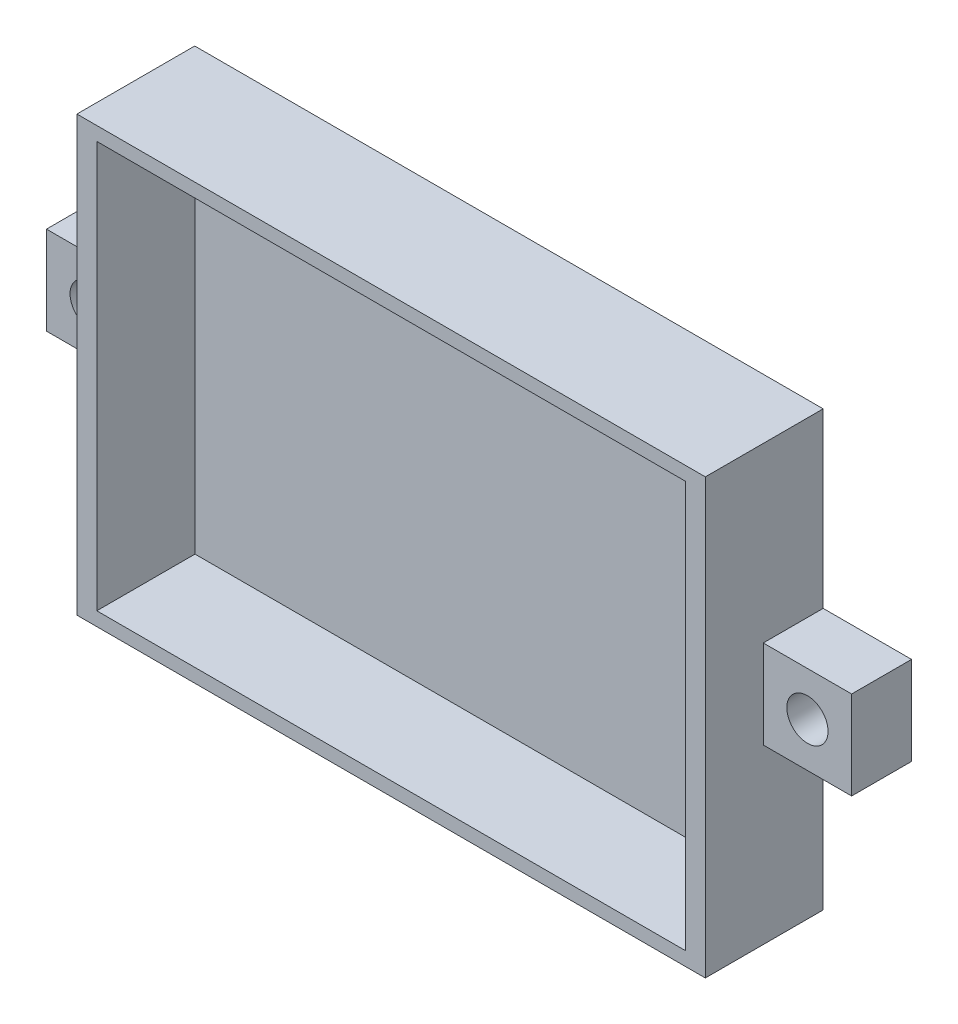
ISO-10303-21;
HEADER;
FILE_DESCRIPTION(('STEP AP214'),'2;1');
FILE_NAME('part.step','',(''),(''),'','','');
FILE_SCHEMA(('AUTOMOTIVE_DESIGN { 1 0 10303 214 1 1 1 1 }'));
ENDSEC;
DATA;
#1=APPLICATION_CONTEXT('core data for automotive mechanical design processes');
#2=APPLICATION_PROTOCOL_DEFINITION('international standard','automotive_design',2000,#1);
#3=PRODUCT_CONTEXT('',#1,'mechanical');
#4=PRODUCT('Part','Part','',(#3));
#5=PRODUCT_RELATED_PRODUCT_CATEGORY('part','',(#4));
#6=PRODUCT_DEFINITION_FORMATION('','',#4);
#7=PRODUCT_DEFINITION_CONTEXT('part definition',#1,'design');
#8=PRODUCT_DEFINITION('design','',#6,#7);
#9=PRODUCT_DEFINITION_SHAPE('','',#8);
#10=(LENGTH_UNIT() NAMED_UNIT(*) SI_UNIT(.MILLI.,.METRE.));
#11=(NAMED_UNIT(*) PLANE_ANGLE_UNIT() SI_UNIT($,.RADIAN.));
#12=(NAMED_UNIT(*) SI_UNIT($,.STERADIAN.) SOLID_ANGLE_UNIT());
#13=UNCERTAINTY_MEASURE_WITH_UNIT(LENGTH_MEASURE(1.E-05),#10,'distance_accuracy_value','');
#14=(GEOMETRIC_REPRESENTATION_CONTEXT(3) GLOBAL_UNCERTAINTY_ASSIGNED_CONTEXT((#13)) GLOBAL_UNIT_ASSIGNED_CONTEXT((#10,
#11,#12)) REPRESENTATION_CONTEXT('',''));
#15=CARTESIAN_POINT('',(0.,0.,0.));
#16=DIRECTION('',(0.,0.,1.));
#17=DIRECTION('',(1.,0.,0.));
#18=AXIS2_PLACEMENT_3D('',#15,#16,#17);
#19=CARTESIAN_POINT('',(0.,22.1,2.));
#20=DIRECTION('',(0.,-1.,0.));
#21=DIRECTION('',(1.,0.,0.));
#22=AXIS2_PLACEMENT_3D('',#19,#20,#21);
#23=PLANE('',#22);
#24=DIRECTION('',(-1.,0.,0.));
#25=VECTOR('',#24,1.);
#26=CARTESIAN_POINT('',(0.,22.1,0.));
#27=LINE('',#26,#25);
#28=CARTESIAN_POINT('',(32.,22.1,0.));
#29=VERTEX_POINT('',#28);
#30=CARTESIAN_POINT('',(-32.,22.1,0.));
#31=VERTEX_POINT('',#30);
#32=EDGE_CURVE('E265',#29,#31,#27,.T.);
#33=ORIENTED_EDGE('',*,*,#32,.T.);
#34=DIRECTION('',(0.,0.,-1.));
#35=VECTOR('',#34,1.);
#36=CARTESIAN_POINT('',(-32.,22.1,2.));
#37=LINE('',#36,#35);
#38=CARTESIAN_POINT('',(-32.,22.1,12.));
#39=VERTEX_POINT('',#38);
#40=EDGE_CURVE('E40',#39,#31,#37,.T.);
#41=ORIENTED_EDGE('',*,*,#40,.F.);
#42=DIRECTION('',(-1.,0.,0.));
#43=VECTOR('',#42,1.);
#44=CARTESIAN_POINT('',(32.,22.1,12.));
#45=LINE('',#44,#43);
#46=CARTESIAN_POINT('',(32.,22.1,12.));
#47=VERTEX_POINT('',#46);
#48=EDGE_CURVE('E194',#47,#39,#45,.T.);
#49=ORIENTED_EDGE('',*,*,#48,.F.);
#50=DIRECTION('',(0.,0.,-1.));
#51=VECTOR('',#50,1.);
#52=CARTESIAN_POINT('',(32.,22.1,2.));
#53=LINE('',#52,#51);
#54=EDGE_CURVE('E279',#47,#29,#53,.T.);
#55=ORIENTED_EDGE('',*,*,#54,.T.);
#56=EDGE_LOOP('',(#33,#41,#49,#55));
#57=FACE_BOUND('',#56,.T.);
#58=ADVANCED_FACE('F37',(#57),#23,.F.);
#59=CARTESIAN_POINT('',(-32.,0.,2.));
#60=DIRECTION('',(1.,0.,0.));
#61=DIRECTION('',(0.,1.,0.));
#62=AXIS2_PLACEMENT_3D('',#59,#60,#61);
#63=PLANE('',#62);
#64=DIRECTION('',(0.,0.,-1.));
#65=VECTOR('',#64,1.);
#66=CARTESIAN_POINT('',(-32.,-22.1,2.));
#67=LINE('',#66,#65);
#68=CARTESIAN_POINT('',(-32.,-22.1,12.));
#69=VERTEX_POINT('',#68);
#70=CARTESIAN_POINT('',(-32.,-22.1,0.));
#71=VERTEX_POINT('',#70);
#72=EDGE_CURVE('E283',#69,#71,#67,.T.);
#73=ORIENTED_EDGE('',*,*,#72,.F.);
#74=DIRECTION('',(0.,-1.,0.));
#75=VECTOR('',#74,1.);
#76=CARTESIAN_POINT('',(-32.,-22.1,12.));
#77=LINE('',#76,#75);
#78=EDGE_CURVE('E164',#39,#69,#77,.T.);
#79=ORIENTED_EDGE('',*,*,#78,.F.);
#80=ORIENTED_EDGE('',*,*,#40,.T.);
#81=DIRECTION('',(0.,-1.,0.));
#82=VECTOR('',#81,1.);
#83=CARTESIAN_POINT('',(-32.,0.,0.));
#84=LINE('',#83,#82);
#85=CARTESIAN_POINT('',(-32.,4.49999999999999,0.));
#86=VERTEX_POINT('',#85);
#87=EDGE_CURVE('E269',#31,#86,#84,.T.);
#88=ORIENTED_EDGE('',*,*,#87,.T.);
#89=DIRECTION('',(0.,0.,-1.));
#90=VECTOR('',#89,1.);
#91=CARTESIAN_POINT('',(-32.,4.49999999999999,6.1));
#92=LINE('',#91,#90);
#93=CARTESIAN_POINT('',(-32.,4.49999999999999,6.1));
#94=VERTEX_POINT('',#93);
#95=EDGE_CURVE('E228',#94,#86,#92,.T.);
#96=ORIENTED_EDGE('',*,*,#95,.F.);
#97=DIRECTION('',(0.,-1.,0.));
#98=VECTOR('',#97,1.);
#99=CARTESIAN_POINT('',(-32.,0.,6.1));
#100=LINE('',#99,#98);
#101=CARTESIAN_POINT('',(-32.,-4.50000000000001,6.1));
#102=VERTEX_POINT('',#101);
#103=EDGE_CURVE('E243',#94,#102,#100,.T.);
#104=ORIENTED_EDGE('',*,*,#103,.T.);
#105=DIRECTION('',(0.,0.,-1.));
#106=VECTOR('',#105,1.);
#107=CARTESIAN_POINT('',(-32.,-4.5,6.1));
#108=LINE('',#107,#106);
#109=CARTESIAN_POINT('',(-32.,-4.5,0.));
#110=VERTEX_POINT('',#109);
#111=EDGE_CURVE('E258',#102,#110,#108,.T.);
#112=ORIENTED_EDGE('',*,*,#111,.T.);
#113=EDGE_CURVE('E268',#110,#71,#84,.T.);
#114=ORIENTED_EDGE('',*,*,#113,.T.);
#115=EDGE_LOOP('',(#73,#79,#80,#88,#96,#104,#112,#114));
#116=FACE_BOUND('',#115,.T.);
#117=ADVANCED_FACE('F291',(#116),#63,.F.);
#118=CARTESIAN_POINT('',(0.,-22.1,2.));
#119=DIRECTION('',(0.,-1.,0.));
#120=DIRECTION('',(1.,0.,0.));
#121=AXIS2_PLACEMENT_3D('',#118,#119,#120);
#122=PLANE('',#121);
#123=DIRECTION('',(-1.,0.,0.));
#124=VECTOR('',#123,1.);
#125=CARTESIAN_POINT('',(0.,-22.1,0.));
#126=LINE('',#125,#124);
#127=CARTESIAN_POINT('',(32.,-22.1,0.));
#128=VERTEX_POINT('',#127);
#129=EDGE_CURVE('E272',#128,#71,#126,.T.);
#130=ORIENTED_EDGE('',*,*,#129,.F.);
#131=DIRECTION('',(0.,0.,-1.));
#132=VECTOR('',#131,1.);
#133=CARTESIAN_POINT('',(32.,-22.1,2.));
#134=LINE('',#133,#132);
#135=CARTESIAN_POINT('',(32.,-22.1,12.));
#136=VERTEX_POINT('',#135);
#137=EDGE_CURVE('E281',#136,#128,#134,.T.);
#138=ORIENTED_EDGE('',*,*,#137,.F.);
#139=DIRECTION('',(1.,0.,0.));
#140=VECTOR('',#139,1.);
#141=CARTESIAN_POINT('',(32.,-22.1,12.));
#142=LINE('',#141,#140);
#143=EDGE_CURVE('E188',#69,#136,#142,.T.);
#144=ORIENTED_EDGE('',*,*,#143,.F.);
#145=ORIENTED_EDGE('',*,*,#72,.T.);
#146=EDGE_LOOP('',(#130,#138,#144,#145));
#147=FACE_BOUND('',#146,.T.);
#148=ADVANCED_FACE('F318',(#147),#122,.T.);
#149=CARTESIAN_POINT('',(32.,0.,2.));
#150=DIRECTION('',(1.,0.,0.));
#151=DIRECTION('',(0.,1.,0.));
#152=AXIS2_PLACEMENT_3D('',#149,#150,#151);
#153=PLANE('',#152);
#154=DIRECTION('',(0.,0.,-1.));
#155=VECTOR('',#154,1.);
#156=CARTESIAN_POINT('',(32.,-4.5,6.1));
#157=LINE('',#156,#155);
#158=CARTESIAN_POINT('',(32.,-4.5,6.1));
#159=VERTEX_POINT('',#158);
#160=CARTESIAN_POINT('',(32.,-4.5,0.));
#161=VERTEX_POINT('',#160);
#162=EDGE_CURVE('E11',#159,#161,#157,.T.);
#163=ORIENTED_EDGE('',*,*,#162,.F.);
#164=DIRECTION('',(0.,-1.,0.));
#165=VECTOR('',#164,1.);
#166=CARTESIAN_POINT('',(32.,0.,6.1));
#167=LINE('',#166,#165);
#168=CARTESIAN_POINT('',(32.,4.5,6.1));
#169=VERTEX_POINT('',#168);
#170=EDGE_CURVE('E208',#169,#159,#167,.T.);
#171=ORIENTED_EDGE('',*,*,#170,.F.);
#172=DIRECTION('',(0.,0.,-1.));
#173=VECTOR('',#172,1.);
#174=CARTESIAN_POINT('',(32.,4.5,6.1));
#175=LINE('',#174,#173);
#176=CARTESIAN_POINT('',(32.,4.5,0.));
#177=VERTEX_POINT('',#176);
#178=EDGE_CURVE('E45',#169,#177,#175,.T.);
#179=ORIENTED_EDGE('',*,*,#178,.T.);
#180=DIRECTION('',(0.,-1.,0.));
#181=VECTOR('',#180,1.);
#182=CARTESIAN_POINT('',(32.,0.,0.));
#183=LINE('',#182,#181);
#184=EDGE_CURVE('E276',#29,#177,#183,.T.);
#185=ORIENTED_EDGE('',*,*,#184,.F.);
#186=ORIENTED_EDGE('',*,*,#54,.F.);
#187=DIRECTION('',(0.,1.,0.));
#188=VECTOR('',#187,1.);
#189=CARTESIAN_POINT('',(32.,-22.1,12.));
#190=LINE('',#189,#188);
#191=EDGE_CURVE('E191',#136,#47,#190,.T.);
#192=ORIENTED_EDGE('',*,*,#191,.F.);
#193=ORIENTED_EDGE('',*,*,#137,.T.);
#194=EDGE_CURVE('E275',#161,#128,#183,.T.);
#195=ORIENTED_EDGE('',*,*,#194,.F.);
#196=EDGE_LOOP('',(#163,#171,#179,#185,#186,#192,#193,#195));
#197=FACE_BOUND('',#196,.T.);
#198=ADVANCED_FACE('F301',(#197),#153,.T.);
#199=CARTESIAN_POINT('',(0.,0.,0.));
#200=DIRECTION('',(0.,0.,1.));
#201=DIRECTION('',(1.,0.,0.));
#202=AXIS2_PLACEMENT_3D('',#199,#200,#201);
#203=PLANE('',#202);
#204=ORIENTED_EDGE('',*,*,#32,.F.);
#205=ORIENTED_EDGE('',*,*,#184,.T.);
#206=DIRECTION('',(1.,0.,0.));
#207=VECTOR('',#206,1.);
#208=CARTESIAN_POINT('',(0.,4.5,0.));
#209=LINE('',#208,#207);
#210=CARTESIAN_POINT('',(41.,4.5,0.));
#211=VERTEX_POINT('',#210);
#212=EDGE_CURVE('E219',#177,#211,#209,.T.);
#213=ORIENTED_EDGE('',*,*,#212,.T.);
#214=DIRECTION('',(0.,-1.,0.));
#215=VECTOR('',#214,1.);
#216=CARTESIAN_POINT('',(41.,0.,0.));
#217=LINE('',#216,#215);
#218=CARTESIAN_POINT('',(41.,-4.5,0.));
#219=VERTEX_POINT('',#218);
#220=EDGE_CURVE('E216',#211,#219,#217,.T.);
#221=ORIENTED_EDGE('',*,*,#220,.T.);
#222=DIRECTION('',(1.,0.,0.));
#223=VECTOR('',#222,1.);
#224=CARTESIAN_POINT('',(0.,-4.5,0.));
#225=LINE('',#224,#223);
#226=EDGE_CURVE('E202',#161,#219,#225,.T.);
#227=ORIENTED_EDGE('',*,*,#226,.F.);
#228=ORIENTED_EDGE('',*,*,#194,.T.);
#229=ORIENTED_EDGE('',*,*,#129,.T.);
#230=ORIENTED_EDGE('',*,*,#113,.F.);
#231=DIRECTION('',(-1.,0.,0.));
#232=VECTOR('',#231,1.);
#233=CARTESIAN_POINT('',(0.,-4.5,0.));
#234=LINE('',#233,#232);
#235=CARTESIAN_POINT('',(-41.,-4.50000000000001,0.));
#236=VERTEX_POINT('',#235);
#237=EDGE_CURVE('E235',#110,#236,#234,.T.);
#238=ORIENTED_EDGE('',*,*,#237,.T.);
#239=DIRECTION('',(0.,-1.,0.));
#240=VECTOR('',#239,1.);
#241=CARTESIAN_POINT('',(-41.,0.,0.));
#242=LINE('',#241,#240);
#243=CARTESIAN_POINT('',(-41.,4.49999999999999,0.));
#244=VERTEX_POINT('',#243);
#245=EDGE_CURVE('E252',#244,#236,#242,.T.);
#246=ORIENTED_EDGE('',*,*,#245,.F.);
#247=DIRECTION('',(-1.,0.,0.));
#248=VECTOR('',#247,1.);
#249=CARTESIAN_POINT('',(0.,4.5,0.));
#250=LINE('',#249,#248);
#251=EDGE_CURVE('E249',#86,#244,#250,.T.);
#252=ORIENTED_EDGE('',*,*,#251,.F.);
#253=ORIENTED_EDGE('',*,*,#87,.F.);
#254=EDGE_LOOP('',(#204,#205,#213,#221,#227,#228,#229,#230,#238,#246,#252,#253));
#255=FACE_BOUND('',#254,.T.);
#256=CARTESIAN_POINT('',(-36.5,0.,0.));
#257=DIRECTION('',(0.,0.,1.));
#258=DIRECTION('',(1.,0.,0.));
#259=AXIS2_PLACEMENT_3D('',#256,#257,#258);
#260=CIRCLE('',#259,2.1);
#261=CARTESIAN_POINT('',(-34.4,0.,0.));
#262=VERTEX_POINT('',#261);
#263=EDGE_CURVE('E230',#262,#262,#260,.T.);
#264=ORIENTED_EDGE('',*,*,#263,.T.);
#265=EDGE_LOOP('',(#264));
#266=FACE_BOUND('',#265,.T.);
#267=CARTESIAN_POINT('',(36.5,0.,0.));
#268=DIRECTION('',(0.,0.,1.));
#269=DIRECTION('',(1.,0.,0.));
#270=AXIS2_PLACEMENT_3D('',#267,#268,#269);
#271=CIRCLE('',#270,2.1);
#272=CARTESIAN_POINT('',(38.6,0.,0.));
#273=VERTEX_POINT('',#272);
#274=EDGE_CURVE('E197',#273,#273,#271,.T.);
#275=ORIENTED_EDGE('',*,*,#274,.T.);
#276=EDGE_LOOP('',(#275));
#277=FACE_BOUND('',#276,.T.);
#278=ADVANCED_FACE('F297',(#255,#266,#277),#203,.F.);
#279=CARTESIAN_POINT('',(0.,4.5,6.1));
#280=DIRECTION('',(0.,-1.,0.));
#281=DIRECTION('',(1.,0.,0.));
#282=AXIS2_PLACEMENT_3D('',#279,#280,#281);
#283=PLANE('',#282);
#284=ORIENTED_EDGE('',*,*,#251,.T.);
#285=DIRECTION('',(0.,0.,-1.));
#286=VECTOR('',#285,1.);
#287=CARTESIAN_POINT('',(-41.,4.49999999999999,6.1));
#288=LINE('',#287,#286);
#289=CARTESIAN_POINT('',(-41.,4.49999999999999,6.1));
#290=VERTEX_POINT('',#289);
#291=EDGE_CURVE('E262',#290,#244,#288,.T.);
#292=ORIENTED_EDGE('',*,*,#291,.F.);
#293=DIRECTION('',(-1.,0.,0.));
#294=VECTOR('',#293,1.);
#295=CARTESIAN_POINT('',(0.,4.5,6.1));
#296=LINE('',#295,#294);
#297=EDGE_CURVE('E234',#94,#290,#296,.T.);
#298=ORIENTED_EDGE('',*,*,#297,.F.);
#299=ORIENTED_EDGE('',*,*,#95,.T.);
#300=EDGE_LOOP('',(#284,#292,#298,#299));
#301=FACE_BOUND('',#300,.T.);
#302=ADVANCED_FACE('F343',(#301),#283,.F.);
#303=CARTESIAN_POINT('',(-41.,0.,6.1));
#304=DIRECTION('',(1.,0.,0.));
#305=DIRECTION('',(0.,0.,-1.));
#306=AXIS2_PLACEMENT_3D('',#303,#304,#305);
#307=PLANE('',#306);
#308=ORIENTED_EDGE('',*,*,#245,.T.);
#309=DIRECTION('',(0.,0.,-1.));
#310=VECTOR('',#309,1.);
#311=CARTESIAN_POINT('',(-41.,-4.50000000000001,6.1));
#312=LINE('',#311,#310);
#313=CARTESIAN_POINT('',(-41.,-4.50000000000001,6.1));
#314=VERTEX_POINT('',#313);
#315=EDGE_CURVE('E246',#314,#236,#312,.T.);
#316=ORIENTED_EDGE('',*,*,#315,.F.);
#317=DIRECTION('',(0.,-1.,0.));
#318=VECTOR('',#317,1.);
#319=CARTESIAN_POINT('',(-41.,0.,6.1));
#320=LINE('',#319,#318);
#321=EDGE_CURVE('E238',#290,#314,#320,.T.);
#322=ORIENTED_EDGE('',*,*,#321,.F.);
#323=ORIENTED_EDGE('',*,*,#291,.T.);
#324=EDGE_LOOP('',(#308,#316,#322,#323));
#325=FACE_BOUND('',#324,.T.);
#326=ADVANCED_FACE('F356',(#325),#307,.F.);
#327=CARTESIAN_POINT('',(0.,-4.5,6.1));
#328=DIRECTION('',(0.,-1.,0.));
#329=DIRECTION('',(1.,0.,0.));
#330=AXIS2_PLACEMENT_3D('',#327,#328,#329);
#331=PLANE('',#330);
#332=ORIENTED_EDGE('',*,*,#237,.F.);
#333=ORIENTED_EDGE('',*,*,#111,.F.);
#334=DIRECTION('',(-1.,0.,0.));
#335=VECTOR('',#334,1.);
#336=CARTESIAN_POINT('',(0.,-4.5,6.1));
#337=LINE('',#336,#335);
#338=EDGE_CURVE('E240',#102,#314,#337,.T.);
#339=ORIENTED_EDGE('',*,*,#338,.T.);
#340=ORIENTED_EDGE('',*,*,#315,.T.);
#341=EDGE_LOOP('',(#332,#333,#339,#340));
#342=FACE_BOUND('',#341,.T.);
#343=ADVANCED_FACE('F352',(#342),#331,.T.);
#344=CARTESIAN_POINT('',(-36.5,0.,6.1));
#345=DIRECTION('',(0.,0.,-1.));
#346=DIRECTION('',(-1.,0.,0.));
#347=AXIS2_PLACEMENT_3D('',#344,#345,#346);
#348=CYLINDRICAL_SURFACE('',#347,2.1);
#349=CARTESIAN_POINT('',(-36.5,0.,6.1));
#350=DIRECTION('',(0.,0.,1.));
#351=DIRECTION('',(1.,0.,0.));
#352=AXIS2_PLACEMENT_3D('',#349,#350,#351);
#353=CIRCLE('',#352,2.1);
#354=CARTESIAN_POINT('',(-34.4,0.,6.1));
#355=VERTEX_POINT('',#354);
#356=EDGE_CURVE('E231',#355,#355,#353,.T.);
#357=ORIENTED_EDGE('',*,*,#356,.T.);
#358=EDGE_LOOP('',(#357));
#359=FACE_BOUND('',#358,.T.);
#360=ORIENTED_EDGE('',*,*,#263,.F.);
#361=EDGE_LOOP('',(#360));
#362=FACE_BOUND('',#361,.T.);
#363=ADVANCED_FACE('F348',(#359,#362),#348,.F.);
#364=CARTESIAN_POINT('',(0.,0.,6.1));
#365=DIRECTION('',(0.,0.,1.));
#366=DIRECTION('',(1.,0.,0.));
#367=AXIS2_PLACEMENT_3D('',#364,#365,#366);
#368=PLANE('',#367);
#369=ORIENTED_EDGE('',*,*,#356,.F.);
#370=EDGE_LOOP('',(#369));
#371=FACE_BOUND('',#370,.T.);
#372=ORIENTED_EDGE('',*,*,#297,.T.);
#373=ORIENTED_EDGE('',*,*,#321,.T.);
#374=ORIENTED_EDGE('',*,*,#338,.F.);
#375=ORIENTED_EDGE('',*,*,#103,.F.);
#376=EDGE_LOOP('',(#372,#373,#374,#375));
#377=FACE_BOUND('',#376,.T.);
#378=ADVANCED_FACE('F351',(#371,#377),#368,.T.);
#379=CARTESIAN_POINT('',(41.,0.,6.1));
#380=DIRECTION('',(1.,0.,0.));
#381=DIRECTION('',(0.,0.,-1.));
#382=AXIS2_PLACEMENT_3D('',#379,#380,#381);
#383=PLANE('',#382);
#384=ORIENTED_EDGE('',*,*,#220,.F.);
#385=DIRECTION('',(0.,0.,-1.));
#386=VECTOR('',#385,1.);
#387=CARTESIAN_POINT('',(41.,4.5,6.1));
#388=LINE('',#387,#386);
#389=CARTESIAN_POINT('',(41.,4.5,6.1));
#390=VERTEX_POINT('',#389);
#391=EDGE_CURVE('E224',#390,#211,#388,.T.);
#392=ORIENTED_EDGE('',*,*,#391,.F.);
#393=DIRECTION('',(0.,-1.,0.));
#394=VECTOR('',#393,1.);
#395=CARTESIAN_POINT('',(41.,0.,6.1));
#396=LINE('',#395,#394);
#397=CARTESIAN_POINT('',(41.,-4.5,6.1));
#398=VERTEX_POINT('',#397);
#399=EDGE_CURVE('E201',#390,#398,#396,.T.);
#400=ORIENTED_EDGE('',*,*,#399,.T.);
#401=DIRECTION('',(0.,0.,-1.));
#402=VECTOR('',#401,1.);
#403=CARTESIAN_POINT('',(41.,-4.5,6.1));
#404=LINE('',#403,#402);
#405=EDGE_CURVE('E213',#398,#219,#404,.T.);
#406=ORIENTED_EDGE('',*,*,#405,.T.);
#407=EDGE_LOOP('',(#384,#392,#400,#406));
#408=FACE_BOUND('',#407,.T.);
#409=ADVANCED_FACE('F311',(#408),#383,.T.);
#410=CARTESIAN_POINT('',(0.,4.5,6.1));
#411=DIRECTION('',(0.,1.,0.));
#412=DIRECTION('',(0.,0.,1.));
#413=AXIS2_PLACEMENT_3D('',#410,#411,#412);
#414=PLANE('',#413);
#415=ORIENTED_EDGE('',*,*,#212,.F.);
#416=ORIENTED_EDGE('',*,*,#178,.F.);
#417=DIRECTION('',(1.,0.,0.));
#418=VECTOR('',#417,1.);
#419=CARTESIAN_POINT('',(0.,4.5,6.1));
#420=LINE('',#419,#418);
#421=EDGE_CURVE('E205',#169,#390,#420,.T.);
#422=ORIENTED_EDGE('',*,*,#421,.T.);
#423=ORIENTED_EDGE('',*,*,#391,.T.);
#424=EDGE_LOOP('',(#415,#416,#422,#423));
#425=FACE_BOUND('',#424,.T.);
#426=ADVANCED_FACE('F306',(#425),#414,.T.);
#427=CARTESIAN_POINT('',(36.5,0.,6.1));
#428=DIRECTION('',(0.,0.,-1.));
#429=DIRECTION('',(-1.,0.,0.));
#430=AXIS2_PLACEMENT_3D('',#427,#428,#429);
#431=CYLINDRICAL_SURFACE('',#430,2.1);
#432=CARTESIAN_POINT('',(36.5,0.,6.1));
#433=DIRECTION('',(0.,0.,1.));
#434=DIRECTION('',(1.,0.,0.));
#435=AXIS2_PLACEMENT_3D('',#432,#433,#434);
#436=CIRCLE('',#435,2.1);
#437=CARTESIAN_POINT('',(38.6,0.,6.1));
#438=VERTEX_POINT('',#437);
#439=EDGE_CURVE('E198',#438,#438,#436,.T.);
#440=ORIENTED_EDGE('',*,*,#439,.T.);
#441=EDGE_LOOP('',(#440));
#442=FACE_BOUND('',#441,.T.);
#443=ORIENTED_EDGE('',*,*,#274,.F.);
#444=EDGE_LOOP('',(#443));
#445=FACE_BOUND('',#444,.T.);
#446=ADVANCED_FACE('F367',(#442,#445),#431,.F.);
#447=CARTESIAN_POINT('',(0.,-4.5,6.1));
#448=DIRECTION('',(0.,1.,0.));
#449=DIRECTION('',(0.,0.,1.));
#450=AXIS2_PLACEMENT_3D('',#447,#448,#449);
#451=PLANE('',#450);
#452=ORIENTED_EDGE('',*,*,#226,.T.);
#453=ORIENTED_EDGE('',*,*,#405,.F.);
#454=DIRECTION('',(1.,0.,0.));
#455=VECTOR('',#454,1.);
#456=CARTESIAN_POINT('',(0.,-4.5,6.1));
#457=LINE('',#456,#455);
#458=EDGE_CURVE('E211',#159,#398,#457,.T.);
#459=ORIENTED_EDGE('',*,*,#458,.F.);
#460=ORIENTED_EDGE('',*,*,#162,.T.);
#461=EDGE_LOOP('',(#452,#453,#459,#460));
#462=FACE_BOUND('',#461,.T.);
#463=ADVANCED_FACE('F316',(#462),#451,.F.);
#464=CARTESIAN_POINT('',(0.,0.,6.1));
#465=DIRECTION('',(0.,0.,1.));
#466=DIRECTION('',(1.,0.,0.));
#467=AXIS2_PLACEMENT_3D('',#464,#465,#466);
#468=PLANE('',#467);
#469=ORIENTED_EDGE('',*,*,#439,.F.);
#470=EDGE_LOOP('',(#469));
#471=FACE_BOUND('',#470,.T.);
#472=ORIENTED_EDGE('',*,*,#399,.F.);
#473=ORIENTED_EDGE('',*,*,#421,.F.);
#474=ORIENTED_EDGE('',*,*,#170,.T.);
#475=ORIENTED_EDGE('',*,*,#458,.T.);
#476=EDGE_LOOP('',(#472,#473,#474,#475));
#477=FACE_BOUND('',#476,.T.);
#478=ADVANCED_FACE('F321',(#471,#477),#468,.T.);
#479=CARTESIAN_POINT('',(0.,0.,12.));
#480=DIRECTION('',(0.,0.,1.));
#481=DIRECTION('',(1.,0.,0.));
#482=AXIS2_PLACEMENT_3D('',#479,#480,#481);
#483=PLANE('',#482);
#484=ORIENTED_EDGE('',*,*,#78,.T.);
#485=ORIENTED_EDGE('',*,*,#143,.T.);
#486=ORIENTED_EDGE('',*,*,#191,.T.);
#487=ORIENTED_EDGE('',*,*,#48,.T.);
#488=EDGE_LOOP('',(#484,#485,#486,#487));
#489=FACE_BOUND('',#488,.T.);
#490=DIRECTION('',(1.,0.,0.));
#491=VECTOR('',#490,1.);
#492=CARTESIAN_POINT('',(29.972850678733,-20.7,12.));
#493=LINE('',#492,#491);
#494=CARTESIAN_POINT('',(-29.9728506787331,-20.7,12.));
#495=VERTEX_POINT('',#494);
#496=CARTESIAN_POINT('',(29.972850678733,-20.7,12.));
#497=VERTEX_POINT('',#496);
#498=EDGE_CURVE('E158',#495,#497,#493,.T.);
#499=ORIENTED_EDGE('',*,*,#498,.F.);
#500=DIRECTION('',(0.,-1.,0.));
#501=VECTOR('',#500,1.);
#502=CARTESIAN_POINT('',(-29.9728506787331,-20.7,12.));
#503=LINE('',#502,#501);
#504=CARTESIAN_POINT('',(-29.9728506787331,20.7,12.));
#505=VERTEX_POINT('',#504);
#506=EDGE_CURVE('E149',#505,#495,#503,.T.);
#507=ORIENTED_EDGE('',*,*,#506,.F.);
#508=DIRECTION('',(-1.,0.,0.));
#509=VECTOR('',#508,1.);
#510=CARTESIAN_POINT('',(29.972850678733,20.7,12.));
#511=LINE('',#510,#509);
#512=CARTESIAN_POINT('',(29.972850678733,20.7,12.));
#513=VERTEX_POINT('',#512);
#514=EDGE_CURVE('E172',#513,#505,#511,.T.);
#515=ORIENTED_EDGE('',*,*,#514,.F.);
#516=DIRECTION('',(0.,1.,0.));
#517=VECTOR('',#516,1.);
#518=CARTESIAN_POINT('',(29.972850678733,-20.7,12.));
#519=LINE('',#518,#517);
#520=EDGE_CURVE('E170',#497,#513,#519,.T.);
#521=ORIENTED_EDGE('',*,*,#520,.F.);
#522=EDGE_LOOP('',(#499,#507,#515,#521));
#523=FACE_BOUND('',#522,.T.);
#524=ADVANCED_FACE('F168',(#489,#523),#483,.T.);
#525=CARTESIAN_POINT('',(-29.9728506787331,-20.7,12.));
#526=DIRECTION('',(1.,0.,0.));
#527=DIRECTION('',(0.,0.,-1.));
#528=AXIS2_PLACEMENT_3D('',#525,#526,#527);
#529=PLANE('',#528);
#530=DIRECTION('',(0.,-1.,0.));
#531=VECTOR('',#530,1.);
#532=CARTESIAN_POINT('',(-29.9728506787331,-20.7,2.));
#533=LINE('',#532,#531);
#534=CARTESIAN_POINT('',(-29.9728506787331,20.7,2.));
#535=VERTEX_POINT('',#534);
#536=CARTESIAN_POINT('',(-29.9728506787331,-20.7,2.));
#537=VERTEX_POINT('',#536);
#538=EDGE_CURVE('E53',#535,#537,#533,.T.);
#539=ORIENTED_EDGE('',*,*,#538,.F.);
#540=DIRECTION('',(0.,0.,-1.));
#541=VECTOR('',#540,1.);
#542=CARTESIAN_POINT('',(-29.9728506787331,20.7,12.));
#543=LINE('',#542,#541);
#544=EDGE_CURVE('E154',#505,#535,#543,.T.);
#545=ORIENTED_EDGE('',*,*,#544,.F.);
#546=ORIENTED_EDGE('',*,*,#506,.T.);
#547=DIRECTION('',(0.,0.,-1.));
#548=VECTOR('',#547,1.);
#549=CARTESIAN_POINT('',(-29.9728506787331,-20.7,12.));
#550=LINE('',#549,#548);
#551=EDGE_CURVE('E152',#495,#537,#550,.T.);
#552=ORIENTED_EDGE('',*,*,#551,.T.);
#553=EDGE_LOOP('',(#539,#545,#546,#552));
#554=FACE_BOUND('',#553,.T.);
#555=ADVANCED_FACE('F151',(#554),#529,.T.);
#556=CARTESIAN_POINT('',(29.972850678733,-20.7,12.));
#557=DIRECTION('',(0.,1.,0.));
#558=DIRECTION('',(0.,0.,1.));
#559=AXIS2_PLACEMENT_3D('',#556,#557,#558);
#560=PLANE('',#559);
#561=DIRECTION('',(1.,0.,0.));
#562=VECTOR('',#561,1.);
#563=CARTESIAN_POINT('',(29.972850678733,-20.7,2.));
#564=LINE('',#563,#562);
#565=CARTESIAN_POINT('',(29.972850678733,-20.7,2.));
#566=VERTEX_POINT('',#565);
#567=EDGE_CURVE('E57',#537,#566,#564,.T.);
#568=ORIENTED_EDGE('',*,*,#567,.F.);
#569=ORIENTED_EDGE('',*,*,#551,.F.);
#570=ORIENTED_EDGE('',*,*,#498,.T.);
#571=DIRECTION('',(0.,0.,-1.));
#572=VECTOR('',#571,1.);
#573=CARTESIAN_POINT('',(29.972850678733,-20.7,12.));
#574=LINE('',#573,#572);
#575=EDGE_CURVE('E165',#497,#566,#574,.T.);
#576=ORIENTED_EDGE('',*,*,#575,.T.);
#577=EDGE_LOOP('',(#568,#569,#570,#576));
#578=FACE_BOUND('',#577,.T.);
#579=ADVANCED_FACE('F162',(#578),#560,.T.);
#580=CARTESIAN_POINT('',(29.972850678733,-20.7,12.));
#581=DIRECTION('',(-1.,0.,0.));
#582=DIRECTION('',(0.,0.,1.));
#583=AXIS2_PLACEMENT_3D('',#580,#581,#582);
#584=PLANE('',#583);
#585=DIRECTION('',(0.,1.,0.));
#586=VECTOR('',#585,1.);
#587=CARTESIAN_POINT('',(29.972850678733,-20.7,2.));
#588=LINE('',#587,#586);
#589=CARTESIAN_POINT('',(29.972850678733,20.7,2.));
#590=VERTEX_POINT('',#589);
#591=EDGE_CURVE('E178',#566,#590,#588,.T.);
#592=ORIENTED_EDGE('',*,*,#591,.F.);
#593=ORIENTED_EDGE('',*,*,#575,.F.);
#594=ORIENTED_EDGE('',*,*,#520,.T.);
#595=DIRECTION('',(0.,0.,-1.));
#596=VECTOR('',#595,1.);
#597=CARTESIAN_POINT('',(29.972850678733,20.7,12.));
#598=LINE('',#597,#596);
#599=EDGE_CURVE('E182',#513,#590,#598,.T.);
#600=ORIENTED_EDGE('',*,*,#599,.T.);
#601=EDGE_LOOP('',(#592,#593,#594,#600));
#602=FACE_BOUND('',#601,.T.);
#603=ADVANCED_FACE('F406',(#602),#584,.T.);
#604=CARTESIAN_POINT('',(29.972850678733,20.7,12.));
#605=DIRECTION('',(0.,-1.,0.));
#606=DIRECTION('',(0.,0.,-1.));
#607=AXIS2_PLACEMENT_3D('',#604,#605,#606);
#608=PLANE('',#607);
#609=DIRECTION('',(-1.,0.,0.));
#610=VECTOR('',#609,1.);
#611=CARTESIAN_POINT('',(29.972850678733,20.7,2.));
#612=LINE('',#611,#610);
#613=EDGE_CURVE('E159',#590,#535,#612,.T.);
#614=ORIENTED_EDGE('',*,*,#613,.F.);
#615=ORIENTED_EDGE('',*,*,#599,.F.);
#616=ORIENTED_EDGE('',*,*,#514,.T.);
#617=ORIENTED_EDGE('',*,*,#544,.T.);
#618=EDGE_LOOP('',(#614,#615,#616,#617));
#619=FACE_BOUND('',#618,.T.);
#620=ADVANCED_FACE('F347',(#619),#608,.T.);
#621=CARTESIAN_POINT('',(0.,0.,2.));
#622=DIRECTION('',(0.,0.,1.));
#623=DIRECTION('',(1.,0.,0.));
#624=AXIS2_PLACEMENT_3D('',#621,#622,#623);
#625=PLANE('',#624);
#626=ORIENTED_EDGE('',*,*,#538,.T.);
#627=ORIENTED_EDGE('',*,*,#567,.T.);
#628=ORIENTED_EDGE('',*,*,#591,.T.);
#629=ORIENTED_EDGE('',*,*,#613,.T.);
#630=EDGE_LOOP('',(#626,#627,#628,#629));
#631=FACE_BOUND('',#630,.T.);
#632=ADVANCED_FACE('F344',(#631),#625,.T.);
#633=CLOSED_SHELL('',(#58,#117,#148,#198,#278,#302,#326,#343,#363,#378,#409,#426,#446,#463,#478,
#524,#555,#579,#603,#620,#632));
#634=MANIFOLD_SOLID_BREP('B2',#633);
#635=ADVANCED_BREP_SHAPE_REPRESENTATION('',(#18,#634),#14);
#636=SHAPE_DEFINITION_REPRESENTATION(#9,#635);
ENDSEC;
END-ISO-10303-21;
